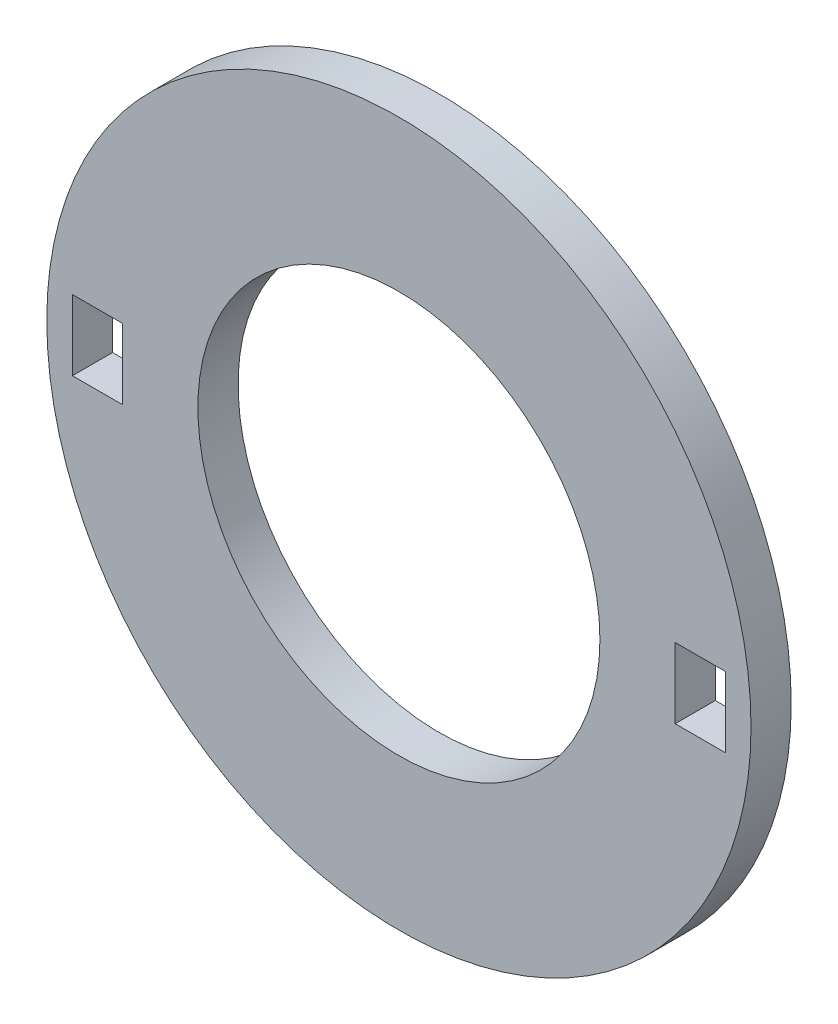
ISO-10303-21;
HEADER;
FILE_DESCRIPTION(('STEP AP214'),'2;1');
FILE_NAME('part.step','',(''),(''),'','','');
FILE_SCHEMA(('AUTOMOTIVE_DESIGN { 1 0 10303 214 1 1 1 1 }'));
ENDSEC;
DATA;
#1=APPLICATION_CONTEXT('core data for automotive mechanical design processes');
#2=APPLICATION_PROTOCOL_DEFINITION('international standard','automotive_design',2000,#1);
#3=PRODUCT_CONTEXT('',#1,'mechanical');
#4=PRODUCT('Part','Part','',(#3));
#5=PRODUCT_RELATED_PRODUCT_CATEGORY('part','',(#4));
#6=PRODUCT_DEFINITION_FORMATION('','',#4);
#7=PRODUCT_DEFINITION_CONTEXT('part definition',#1,'design');
#8=PRODUCT_DEFINITION('design','',#6,#7);
#9=PRODUCT_DEFINITION_SHAPE('','',#8);
#10=(LENGTH_UNIT() NAMED_UNIT(*) SI_UNIT(.MILLI.,.METRE.));
#11=(NAMED_UNIT(*) PLANE_ANGLE_UNIT() SI_UNIT($,.RADIAN.));
#12=(NAMED_UNIT(*) SI_UNIT($,.STERADIAN.) SOLID_ANGLE_UNIT());
#13=UNCERTAINTY_MEASURE_WITH_UNIT(LENGTH_MEASURE(1.E-05),#10,'distance_accuracy_value','');
#14=(GEOMETRIC_REPRESENTATION_CONTEXT(3) GLOBAL_UNCERTAINTY_ASSIGNED_CONTEXT((#13)) GLOBAL_UNIT_ASSIGNED_CONTEXT((#10,
#11,#12)) REPRESENTATION_CONTEXT('',''));
#15=CARTESIAN_POINT('',(0.,0.,0.));
#16=DIRECTION('',(0.,0.,1.));
#17=DIRECTION('',(1.,0.,0.));
#18=AXIS2_PLACEMENT_3D('',#15,#16,#17);
#19=CARTESIAN_POINT('',(0.,0.,4.));
#20=DIRECTION('',(0.,0.,1.));
#21=DIRECTION('',(1.,0.,0.));
#22=AXIS2_PLACEMENT_3D('',#19,#20,#21);
#23=PLANE('',#22);
#24=CARTESIAN_POINT('',(0.,0.,4.));
#25=DIRECTION('',(0.,0.,1.));
#26=DIRECTION('',(1.,0.,0.));
#27=AXIS2_PLACEMENT_3D('',#24,#25,#26);
#28=CIRCLE('',#27,35.0334056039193);
#29=CARTESIAN_POINT('',(35.0334056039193,0.,4.));
#30=VERTEX_POINT('',#29);
#31=EDGE_CURVE('E11',#30,#30,#28,.T.);
#32=ORIENTED_EDGE('',*,*,#31,.T.);
#33=EDGE_LOOP('',(#32));
#34=FACE_BOUND('',#33,.T.);
#35=CARTESIAN_POINT('',(0.,0.,4.));
#36=DIRECTION('',(0.,0.,1.));
#37=DIRECTION('',(1.,0.,0.));
#38=AXIS2_PLACEMENT_3D('',#35,#36,#37);
#39=CIRCLE('',#38,20.);
#40=CARTESIAN_POINT('',(20.,0.,4.));
#41=VERTEX_POINT('',#40);
#42=EDGE_CURVE('E165',#41,#41,#39,.T.);
#43=ORIENTED_EDGE('',*,*,#42,.F.);
#44=EDGE_LOOP('',(#43));
#45=FACE_BOUND('',#44,.T.);
#46=DIRECTION('',(-1.,0.,0.));
#47=VECTOR('',#46,1.);
#48=CARTESIAN_POINT('',(-32.4842775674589,3.49999999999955,4.));
#49=LINE('',#48,#47);
#50=CARTESIAN_POINT('',(-27.4842775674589,3.49999999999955,4.));
#51=VERTEX_POINT('',#50);
#52=CARTESIAN_POINT('',(-32.4842775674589,3.49999999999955,4.));
#53=VERTEX_POINT('',#52);
#54=EDGE_CURVE('E136',#51,#53,#49,.T.);
#55=ORIENTED_EDGE('',*,*,#54,.F.);
#56=DIRECTION('',(0.,1.,0.));
#57=VECTOR('',#56,1.);
#58=CARTESIAN_POINT('',(-27.4842775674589,3.49999999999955,4.));
#59=LINE('',#58,#57);
#60=CARTESIAN_POINT('',(-27.4842775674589,-3.50000000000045,4.));
#61=VERTEX_POINT('',#60);
#62=EDGE_CURVE('E134',#61,#51,#59,.T.);
#63=ORIENTED_EDGE('',*,*,#62,.F.);
#64=DIRECTION('',(1.,0.,0.));
#65=VECTOR('',#64,1.);
#66=CARTESIAN_POINT('',(-32.4842775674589,-3.50000000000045,4.));
#67=LINE('',#66,#65);
#68=CARTESIAN_POINT('',(-32.4842775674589,-3.50000000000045,4.));
#69=VERTEX_POINT('',#68);
#70=EDGE_CURVE('E142',#69,#61,#67,.T.);
#71=ORIENTED_EDGE('',*,*,#70,.F.);
#72=DIRECTION('',(0.,-1.,0.));
#73=VECTOR('',#72,1.);
#74=CARTESIAN_POINT('',(-32.4842775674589,3.49999999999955,4.));
#75=LINE('',#74,#73);
#76=EDGE_CURVE('E139',#53,#69,#75,.T.);
#77=ORIENTED_EDGE('',*,*,#76,.F.);
#78=EDGE_LOOP('',(#55,#63,#71,#77));
#79=FACE_BOUND('',#78,.T.);
#80=DIRECTION('',(-4.03942752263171E-13,-1.,0.));
#81=VECTOR('',#80,1.);
#82=CARTESIAN_POINT('',(27.4842775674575,-3.50000000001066,4.));
#83=LINE('',#82,#81);
#84=CARTESIAN_POINT('',(27.4842775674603,3.49999999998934,4.));
#85=VERTEX_POINT('',#84);
#86=CARTESIAN_POINT('',(27.4842775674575,-3.50000000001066,4.));
#87=VERTEX_POINT('',#86);
#88=EDGE_CURVE('E106',#85,#87,#83,.T.);
#89=ORIENTED_EDGE('',*,*,#88,.F.);
#90=DIRECTION('',(-1.,4.04190569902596E-13,0.));
#91=VECTOR('',#90,1.);
#92=CARTESIAN_POINT('',(32.4842775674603,3.49999999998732,4.));
#93=LINE('',#92,#91);
#94=CARTESIAN_POINT('',(32.4842775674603,3.49999999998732,4.));
#95=VERTEX_POINT('',#94);
#96=EDGE_CURVE('E98',#95,#85,#93,.T.);
#97=ORIENTED_EDGE('',*,*,#96,.F.);
#98=DIRECTION('',(4.04438387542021E-13,1.,0.));
#99=VECTOR('',#98,1.);
#100=CARTESIAN_POINT('',(32.4842775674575,-3.50000000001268,4.));
#101=LINE('',#100,#99);
#102=CARTESIAN_POINT('',(32.4842775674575,-3.50000000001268,4.));
#103=VERTEX_POINT('',#102);
#104=EDGE_CURVE('E120',#103,#95,#101,.T.);
#105=ORIENTED_EDGE('',*,*,#104,.F.);
#106=DIRECTION('',(1.,-4.04190569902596E-13,0.));
#107=VECTOR('',#106,1.);
#108=CARTESIAN_POINT('',(32.4842775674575,-3.50000000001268,4.));
#109=LINE('',#108,#107);
#110=EDGE_CURVE('E118',#87,#103,#109,.T.);
#111=ORIENTED_EDGE('',*,*,#110,.F.);
#112=EDGE_LOOP('',(#89,#97,#105,#111));
#113=FACE_BOUND('',#112,.T.);
#114=ADVANCED_FACE('F33',(#34,#45,#79,#113),#23,.T.);
#115=CARTESIAN_POINT('',(0.,0.,0.));
#116=DIRECTION('',(0.,0.,1.));
#117=DIRECTION('',(1.,0.,0.));
#118=AXIS2_PLACEMENT_3D('',#115,#116,#117);
#119=PLANE('',#118);
#120=DIRECTION('',(0.,1.,0.));
#121=VECTOR('',#120,1.);
#122=CARTESIAN_POINT('',(-27.4842775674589,3.49999999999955,0.));
#123=LINE('',#122,#121);
#124=CARTESIAN_POINT('',(-27.4842775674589,-3.50000000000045,0.));
#125=VERTEX_POINT('',#124);
#126=CARTESIAN_POINT('',(-27.4842775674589,3.49999999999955,0.));
#127=VERTEX_POINT('',#126);
#128=EDGE_CURVE('E114',#125,#127,#123,.T.);
#129=ORIENTED_EDGE('',*,*,#128,.T.);
#130=DIRECTION('',(-1.,0.,0.));
#131=VECTOR('',#130,1.);
#132=CARTESIAN_POINT('',(-32.4842775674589,3.49999999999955,0.));
#133=LINE('',#132,#131);
#134=CARTESIAN_POINT('',(-32.4842775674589,3.49999999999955,0.));
#135=VERTEX_POINT('',#134);
#136=EDGE_CURVE('E147',#127,#135,#133,.T.);
#137=ORIENTED_EDGE('',*,*,#136,.T.);
#138=DIRECTION('',(0.,-1.,0.));
#139=VECTOR('',#138,1.);
#140=CARTESIAN_POINT('',(-32.4842775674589,3.49999999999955,0.));
#141=LINE('',#140,#139);
#142=CARTESIAN_POINT('',(-32.4842775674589,-3.50000000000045,0.));
#143=VERTEX_POINT('',#142);
#144=EDGE_CURVE('E150',#135,#143,#141,.T.);
#145=ORIENTED_EDGE('',*,*,#144,.T.);
#146=DIRECTION('',(1.,0.,0.));
#147=VECTOR('',#146,1.);
#148=CARTESIAN_POINT('',(-32.4842775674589,-3.50000000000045,0.));
#149=LINE('',#148,#147);
#150=EDGE_CURVE('E137',#143,#125,#149,.T.);
#151=ORIENTED_EDGE('',*,*,#150,.T.);
#152=EDGE_LOOP('',(#129,#137,#145,#151));
#153=FACE_BOUND('',#152,.T.);
#154=CARTESIAN_POINT('',(0.,0.,0.));
#155=DIRECTION('',(0.,0.,1.));
#156=DIRECTION('',(1.,0.,0.));
#157=AXIS2_PLACEMENT_3D('',#154,#155,#156);
#158=CIRCLE('',#157,35.0334056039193);
#159=CARTESIAN_POINT('',(35.0334056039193,0.,0.));
#160=VERTEX_POINT('',#159);
#161=EDGE_CURVE('E37',#160,#160,#158,.T.);
#162=ORIENTED_EDGE('',*,*,#161,.F.);
#163=EDGE_LOOP('',(#162));
#164=FACE_BOUND('',#163,.T.);
#165=CARTESIAN_POINT('',(0.,0.,0.));
#166=DIRECTION('',(0.,0.,1.));
#167=DIRECTION('',(1.,0.,0.));
#168=AXIS2_PLACEMENT_3D('',#165,#166,#167);
#169=CIRCLE('',#168,20.);
#170=CARTESIAN_POINT('',(20.,0.,0.));
#171=VERTEX_POINT('',#170);
#172=EDGE_CURVE('E164',#171,#171,#169,.T.);
#173=ORIENTED_EDGE('',*,*,#172,.T.);
#174=EDGE_LOOP('',(#173));
#175=FACE_BOUND('',#174,.T.);
#176=DIRECTION('',(-1.,4.04190569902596E-13,0.));
#177=VECTOR('',#176,1.);
#178=CARTESIAN_POINT('',(32.4842775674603,3.49999999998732,0.));
#179=LINE('',#178,#177);
#180=CARTESIAN_POINT('',(32.4842775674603,3.49999999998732,0.));
#181=VERTEX_POINT('',#180);
#182=CARTESIAN_POINT('',(27.4842775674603,3.49999999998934,0.));
#183=VERTEX_POINT('',#182);
#184=EDGE_CURVE('E56',#181,#183,#179,.T.);
#185=ORIENTED_EDGE('',*,*,#184,.T.);
#186=DIRECTION('',(-4.03942752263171E-13,-1.,0.));
#187=VECTOR('',#186,1.);
#188=CARTESIAN_POINT('',(27.4842775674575,-3.50000000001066,0.));
#189=LINE('',#188,#187);
#190=CARTESIAN_POINT('',(27.4842775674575,-3.50000000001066,0.));
#191=VERTEX_POINT('',#190);
#192=EDGE_CURVE('E113',#183,#191,#189,.T.);
#193=ORIENTED_EDGE('',*,*,#192,.T.);
#194=DIRECTION('',(1.,-4.04190569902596E-13,0.));
#195=VECTOR('',#194,1.);
#196=CARTESIAN_POINT('',(32.4842775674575,-3.50000000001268,0.));
#197=LINE('',#196,#195);
#198=CARTESIAN_POINT('',(32.4842775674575,-3.50000000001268,0.));
#199=VERTEX_POINT('',#198);
#200=EDGE_CURVE('E126',#191,#199,#197,.T.);
#201=ORIENTED_EDGE('',*,*,#200,.T.);
#202=DIRECTION('',(4.04438387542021E-13,1.,0.));
#203=VECTOR('',#202,1.);
#204=CARTESIAN_POINT('',(32.4842775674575,-3.50000000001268,0.));
#205=LINE('',#204,#203);
#206=EDGE_CURVE('E107',#199,#181,#205,.T.);
#207=ORIENTED_EDGE('',*,*,#206,.T.);
#208=EDGE_LOOP('',(#185,#193,#201,#207));
#209=FACE_BOUND('',#208,.T.);
#210=ADVANCED_FACE('F171',(#153,#164,#175,#209),#119,.F.);
#211=CARTESIAN_POINT('',(0.,0.,4.));
#212=DIRECTION('',(0.,0.,-1.));
#213=DIRECTION('',(-1.,0.,0.));
#214=AXIS2_PLACEMENT_3D('',#211,#212,#213);
#215=CYLINDRICAL_SURFACE('',#214,35.0334056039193);
#216=ORIENTED_EDGE('',*,*,#31,.F.);
#217=EDGE_LOOP('',(#216));
#218=FACE_BOUND('',#217,.T.);
#219=ORIENTED_EDGE('',*,*,#161,.T.);
#220=EDGE_LOOP('',(#219));
#221=FACE_BOUND('',#220,.T.);
#222=ADVANCED_FACE('F35',(#218,#221),#215,.T.);
#223=CARTESIAN_POINT('',(0.,0.,4.));
#224=DIRECTION('',(0.,0.,-1.));
#225=DIRECTION('',(-1.,0.,0.));
#226=AXIS2_PLACEMENT_3D('',#223,#224,#225);
#227=CYLINDRICAL_SURFACE('',#226,20.);
#228=ORIENTED_EDGE('',*,*,#42,.T.);
#229=EDGE_LOOP('',(#228));
#230=FACE_BOUND('',#229,.T.);
#231=ORIENTED_EDGE('',*,*,#172,.F.);
#232=EDGE_LOOP('',(#231));
#233=FACE_BOUND('',#232,.T.);
#234=ADVANCED_FACE('F174',(#230,#233),#227,.F.);
#235=CARTESIAN_POINT('',(-27.4842775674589,3.49999999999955,4.));
#236=DIRECTION('',(-1.,0.,0.));
#237=DIRECTION('',(0.,-1.,0.));
#238=AXIS2_PLACEMENT_3D('',#235,#236,#237);
#239=PLANE('',#238);
#240=ORIENTED_EDGE('',*,*,#128,.F.);
#241=DIRECTION('',(0.,0.,-1.));
#242=VECTOR('',#241,1.);
#243=CARTESIAN_POINT('',(-27.4842775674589,-3.50000000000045,4.));
#244=LINE('',#243,#242);
#245=EDGE_CURVE('E144',#61,#125,#244,.T.);
#246=ORIENTED_EDGE('',*,*,#245,.F.);
#247=ORIENTED_EDGE('',*,*,#62,.T.);
#248=DIRECTION('',(0.,0.,-1.));
#249=VECTOR('',#248,1.);
#250=CARTESIAN_POINT('',(-27.4842775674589,3.49999999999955,4.));
#251=LINE('',#250,#249);
#252=EDGE_CURVE('E161',#51,#127,#251,.T.);
#253=ORIENTED_EDGE('',*,*,#252,.T.);
#254=EDGE_LOOP('',(#240,#246,#247,#253));
#255=FACE_BOUND('',#254,.T.);
#256=ADVANCED_FACE('F176',(#255),#239,.T.);
#257=CARTESIAN_POINT('',(-32.4842775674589,3.49999999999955,4.));
#258=DIRECTION('',(0.,-1.,0.));
#259=DIRECTION('',(0.,0.,-1.));
#260=AXIS2_PLACEMENT_3D('',#257,#258,#259);
#261=PLANE('',#260);
#262=ORIENTED_EDGE('',*,*,#136,.F.);
#263=ORIENTED_EDGE('',*,*,#252,.F.);
#264=ORIENTED_EDGE('',*,*,#54,.T.);
#265=DIRECTION('',(0.,0.,-1.));
#266=VECTOR('',#265,1.);
#267=CARTESIAN_POINT('',(-32.4842775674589,3.49999999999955,4.));
#268=LINE('',#267,#266);
#269=EDGE_CURVE('E159',#53,#135,#268,.T.);
#270=ORIENTED_EDGE('',*,*,#269,.T.);
#271=EDGE_LOOP('',(#262,#263,#264,#270));
#272=FACE_BOUND('',#271,.T.);
#273=ADVANCED_FACE('F183',(#272),#261,.T.);
#274=CARTESIAN_POINT('',(-32.4842775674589,3.49999999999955,4.));
#275=DIRECTION('',(1.,0.,0.));
#276=DIRECTION('',(0.,0.,-1.));
#277=AXIS2_PLACEMENT_3D('',#274,#275,#276);
#278=PLANE('',#277);
#279=ORIENTED_EDGE('',*,*,#144,.F.);
#280=ORIENTED_EDGE('',*,*,#269,.F.);
#281=ORIENTED_EDGE('',*,*,#76,.T.);
#282=DIRECTION('',(0.,0.,-1.));
#283=VECTOR('',#282,1.);
#284=CARTESIAN_POINT('',(-32.4842775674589,-3.50000000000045,4.));
#285=LINE('',#284,#283);
#286=EDGE_CURVE('E157',#69,#143,#285,.T.);
#287=ORIENTED_EDGE('',*,*,#286,.T.);
#288=EDGE_LOOP('',(#279,#280,#281,#287));
#289=FACE_BOUND('',#288,.T.);
#290=ADVANCED_FACE('F207',(#289),#278,.T.);
#291=CARTESIAN_POINT('',(-32.4842775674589,-3.50000000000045,4.));
#292=DIRECTION('',(0.,1.,0.));
#293=DIRECTION('',(0.,0.,1.));
#294=AXIS2_PLACEMENT_3D('',#291,#292,#293);
#295=PLANE('',#294);
#296=ORIENTED_EDGE('',*,*,#150,.F.);
#297=ORIENTED_EDGE('',*,*,#286,.F.);
#298=ORIENTED_EDGE('',*,*,#70,.T.);
#299=ORIENTED_EDGE('',*,*,#245,.T.);
#300=EDGE_LOOP('',(#296,#297,#298,#299));
#301=FACE_BOUND('',#300,.T.);
#302=ADVANCED_FACE('F212',(#301),#295,.T.);
#303=CARTESIAN_POINT('',(32.4842775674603,3.49999999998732,4.));
#304=DIRECTION('',(-4.04190569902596E-13,-1.,0.));
#305=DIRECTION('',(1.,-4.04190569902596E-13,0.));
#306=AXIS2_PLACEMENT_3D('',#303,#304,#305);
#307=PLANE('',#306);
#308=ORIENTED_EDGE('',*,*,#184,.F.);
#309=DIRECTION('',(0.,0.,-1.));
#310=VECTOR('',#309,1.);
#311=CARTESIAN_POINT('',(32.4842775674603,3.49999999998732,4.));
#312=LINE('',#311,#310);
#313=EDGE_CURVE('E102',#95,#181,#312,.T.);
#314=ORIENTED_EDGE('',*,*,#313,.F.);
#315=ORIENTED_EDGE('',*,*,#96,.T.);
#316=DIRECTION('',(0.,0.,-1.));
#317=VECTOR('',#316,1.);
#318=CARTESIAN_POINT('',(27.4842775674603,3.49999999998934,4.));
#319=LINE('',#318,#317);
#320=EDGE_CURVE('E101',#85,#183,#319,.T.);
#321=ORIENTED_EDGE('',*,*,#320,.T.);
#322=EDGE_LOOP('',(#308,#314,#315,#321));
#323=FACE_BOUND('',#322,.T.);
#324=ADVANCED_FACE('F100',(#323),#307,.T.);
#325=CARTESIAN_POINT('',(27.4842775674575,-3.50000000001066,4.));
#326=DIRECTION('',(1.,-4.03942752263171E-13,0.));
#327=DIRECTION('',(4.03942752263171E-13,1.,0.));
#328=AXIS2_PLACEMENT_3D('',#325,#326,#327);
#329=PLANE('',#328);
#330=ORIENTED_EDGE('',*,*,#192,.F.);
#331=ORIENTED_EDGE('',*,*,#320,.F.);
#332=ORIENTED_EDGE('',*,*,#88,.T.);
#333=DIRECTION('',(0.,0.,-1.));
#334=VECTOR('',#333,1.);
#335=CARTESIAN_POINT('',(27.4842775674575,-3.50000000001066,4.));
#336=LINE('',#335,#334);
#337=EDGE_CURVE('E115',#87,#191,#336,.T.);
#338=ORIENTED_EDGE('',*,*,#337,.T.);
#339=EDGE_LOOP('',(#330,#331,#332,#338));
#340=FACE_BOUND('',#339,.T.);
#341=ADVANCED_FACE('F110',(#340),#329,.T.);
#342=CARTESIAN_POINT('',(32.4842775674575,-3.50000000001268,4.));
#343=DIRECTION('',(4.04190569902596E-13,1.,0.));
#344=DIRECTION('',(-1.,4.04190569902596E-13,0.));
#345=AXIS2_PLACEMENT_3D('',#342,#343,#344);
#346=PLANE('',#345);
#347=ORIENTED_EDGE('',*,*,#200,.F.);
#348=ORIENTED_EDGE('',*,*,#337,.F.);
#349=ORIENTED_EDGE('',*,*,#110,.T.);
#350=DIRECTION('',(0.,0.,-1.));
#351=VECTOR('',#350,1.);
#352=CARTESIAN_POINT('',(32.4842775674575,-3.50000000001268,4.));
#353=LINE('',#352,#351);
#354=EDGE_CURVE('E48',#103,#199,#353,.T.);
#355=ORIENTED_EDGE('',*,*,#354,.T.);
#356=EDGE_LOOP('',(#347,#348,#349,#355));
#357=FACE_BOUND('',#356,.T.);
#358=ADVANCED_FACE('F251',(#357),#346,.T.);
#359=CARTESIAN_POINT('',(32.4842775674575,-3.50000000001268,4.));
#360=DIRECTION('',(-1.,4.04438387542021E-13,0.));
#361=DIRECTION('',(-4.04438387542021E-13,-1.,0.));
#362=AXIS2_PLACEMENT_3D('',#359,#360,#361);
#363=PLANE('',#362);
#364=ORIENTED_EDGE('',*,*,#206,.F.);
#365=ORIENTED_EDGE('',*,*,#354,.F.);
#366=ORIENTED_EDGE('',*,*,#104,.T.);
#367=ORIENTED_EDGE('',*,*,#313,.T.);
#368=EDGE_LOOP('',(#364,#365,#366,#367));
#369=FACE_BOUND('',#368,.T.);
#370=ADVANCED_FACE('F259',(#369),#363,.T.);
#371=CLOSED_SHELL('',(#114,#210,#222,#234,#256,#273,#290,#302,#324,#341,#358,#370));
#372=MANIFOLD_SOLID_BREP('B2',#371);
#373=ADVANCED_BREP_SHAPE_REPRESENTATION('',(#18,#372),#14);
#374=SHAPE_DEFINITION_REPRESENTATION(#9,#373);
ENDSEC;
END-ISO-10303-21;
